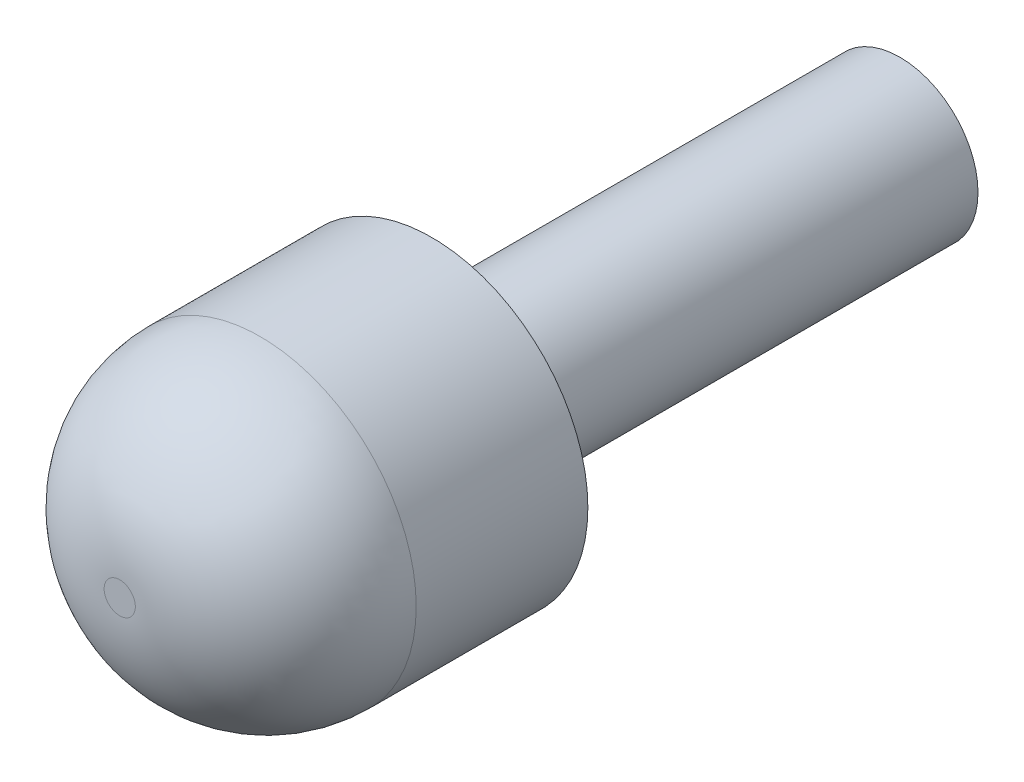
ISO-10303-21;
HEADER;
FILE_DESCRIPTION(('STEP AP214'),'2;1');
FILE_NAME('part.step','',(''),(''),'','','');
FILE_SCHEMA(('AUTOMOTIVE_DESIGN { 1 0 10303 214 1 1 1 1 }'));
ENDSEC;
DATA;
#1=APPLICATION_CONTEXT('core data for automotive mechanical design processes');
#2=APPLICATION_PROTOCOL_DEFINITION('international standard','automotive_design',2000,#1);
#3=PRODUCT_CONTEXT('',#1,'mechanical');
#4=PRODUCT('Part','Part','',(#3));
#5=PRODUCT_RELATED_PRODUCT_CATEGORY('part','',(#4));
#6=PRODUCT_DEFINITION_FORMATION('','',#4);
#7=PRODUCT_DEFINITION_CONTEXT('part definition',#1,'design');
#8=PRODUCT_DEFINITION('design','',#6,#7);
#9=PRODUCT_DEFINITION_SHAPE('','',#8);
#10=(LENGTH_UNIT() NAMED_UNIT(*) SI_UNIT(.MILLI.,.METRE.));
#11=(NAMED_UNIT(*) PLANE_ANGLE_UNIT() SI_UNIT($,.RADIAN.));
#12=(NAMED_UNIT(*) SI_UNIT($,.STERADIAN.) SOLID_ANGLE_UNIT());
#13=UNCERTAINTY_MEASURE_WITH_UNIT(LENGTH_MEASURE(1.E-05),#10,'distance_accuracy_value','');
#14=(GEOMETRIC_REPRESENTATION_CONTEXT(3) GLOBAL_UNCERTAINTY_ASSIGNED_CONTEXT((#13)) GLOBAL_UNIT_ASSIGNED_CONTEXT((#10,
#11,#12)) REPRESENTATION_CONTEXT('',''));
#15=CARTESIAN_POINT('',(0.,0.,0.));
#16=DIRECTION('',(0.,0.,1.));
#17=DIRECTION('',(1.,0.,0.));
#18=AXIS2_PLACEMENT_3D('',#15,#16,#17);
#19=CARTESIAN_POINT('',(0.,0.,-4.));
#20=DIRECTION('',(0.,0.,1.));
#21=DIRECTION('',(1.,0.,0.));
#22=AXIS2_PLACEMENT_3D('',#19,#20,#21);
#23=PLANE('',#22);
#24=CARTESIAN_POINT('',(0.,0.,-4.));
#25=DIRECTION('',(0.,0.,1.));
#26=DIRECTION('',(1.,0.,0.));
#27=AXIS2_PLACEMENT_3D('',#24,#25,#26);
#28=CIRCLE('',#27,2.);
#29=CARTESIAN_POINT('',(2.,0.,-4.));
#30=VERTEX_POINT('',#29);
#31=EDGE_CURVE('E122',#30,#30,#28,.T.);
#32=ORIENTED_EDGE('',*,*,#31,.F.);
#33=EDGE_LOOP('',(#32));
#34=FACE_BOUND('',#33,.T.);
#35=CARTESIAN_POINT('',(0.,0.,-4.));
#36=DIRECTION('',(0.,0.,1.));
#37=DIRECTION('',(1.,0.,0.));
#38=AXIS2_PLACEMENT_3D('',#35,#36,#37);
#39=CIRCLE('',#38,1.);
#40=CARTESIAN_POINT('',(1.,0.,-4.));
#41=VERTEX_POINT('',#40);
#42=EDGE_CURVE('E11',#41,#41,#39,.F.);
#43=ORIENTED_EDGE('',*,*,#42,.F.);
#44=EDGE_LOOP('',(#43));
#45=FACE_BOUND('',#44,.T.);
#46=ADVANCED_FACE('F41',(#34,#45),#23,.F.);
#47=CARTESIAN_POINT('',(0.,0.,-4.));
#48=DIRECTION('',(0.,0.,1.));
#49=DIRECTION('',(1.,0.,0.));
#50=AXIS2_PLACEMENT_3D('',#47,#48,#49);
#51=CYLINDRICAL_SURFACE('',#50,2.);
#52=CARTESIAN_POINT('',(0.,0.,-1.8));
#53=DIRECTION('',(0.,0.,1.));
#54=DIRECTION('',(1.,0.,0.));
#55=AXIS2_PLACEMENT_3D('',#52,#53,#54);
#56=CIRCLE('',#55,2.);
#57=CARTESIAN_POINT('',(2.,0.,-1.8));
#58=VERTEX_POINT('',#57);
#59=EDGE_CURVE('E47',#58,#58,#56,.F.);
#60=ORIENTED_EDGE('',*,*,#59,.T.);
#61=EDGE_LOOP('',(#60));
#62=FACE_BOUND('',#61,.T.);
#63=ORIENTED_EDGE('',*,*,#31,.T.);
#64=EDGE_LOOP('',(#63));
#65=FACE_BOUND('',#64,.T.);
#66=ADVANCED_FACE('F128',(#62,#65),#51,.T.);
#67=CARTESIAN_POINT('',(0.,0.,0.));
#68=DIRECTION('',(0.,0.,1.));
#69=DIRECTION('',(1.,0.,0.));
#70=AXIS2_PLACEMENT_3D('',#67,#68,#69);
#71=PLANE('',#70);
#72=CARTESIAN_POINT('',(0.,0.,0.));
#73=DIRECTION('',(0.,0.,1.));
#74=DIRECTION('',(1.,0.,0.));
#75=AXIS2_PLACEMENT_3D('',#72,#73,#74);
#76=CIRCLE('',#75,0.2);
#77=CARTESIAN_POINT('',(0.2,0.,0.));
#78=VERTEX_POINT('',#77);
#79=EDGE_CURVE('E125',#78,#78,#76,.T.);
#80=ORIENTED_EDGE('',*,*,#79,.T.);
#81=EDGE_LOOP('',(#80));
#82=FACE_BOUND('',#81,.T.);
#83=ADVANCED_FACE('F136',(#82),#71,.T.);
#84=CARTESIAN_POINT('',(0.,0.,-1.8));
#85=DIRECTION('',(0.,0.,1.));
#86=DIRECTION('',(1.,0.,0.));
#87=AXIS2_PLACEMENT_3D('',#84,#85,#86);
#88=DEGENERATE_TOROIDAL_SURFACE('',#87,0.2,1.8,.T.);
#89=ORIENTED_EDGE('',*,*,#59,.F.);
#90=EDGE_LOOP('',(#89));
#91=FACE_BOUND('',#90,.T.);
#92=ORIENTED_EDGE('',*,*,#79,.F.);
#93=EDGE_LOOP('',(#92));
#94=FACE_BOUND('',#93,.T.);
#95=ADVANCED_FACE('F43',(#91,#94),#88,.T.);
#96=CARTESIAN_POINT('',(0.,0.,-10.));
#97=DIRECTION('',(0.,0.,1.));
#98=DIRECTION('',(1.,0.,0.));
#99=AXIS2_PLACEMENT_3D('',#96,#97,#98);
#100=CYLINDRICAL_SURFACE('',#99,1.);
#101=CARTESIAN_POINT('',(0.,0.,-10.));
#102=DIRECTION('',(0.,0.,-1.));
#103=DIRECTION('',(-1.,0.,0.));
#104=AXIS2_PLACEMENT_3D('',#101,#102,#103);
#105=CIRCLE('',#104,1.);
#106=CARTESIAN_POINT('',(-1.,0.,-10.));
#107=VERTEX_POINT('',#106);
#108=EDGE_CURVE('E117',#107,#107,#105,.T.);
#109=ORIENTED_EDGE('',*,*,#108,.F.);
#110=EDGE_LOOP('',(#109));
#111=FACE_BOUND('',#110,.T.);
#112=ORIENTED_EDGE('',*,*,#42,.T.);
#113=EDGE_LOOP('',(#112));
#114=FACE_BOUND('',#113,.T.);
#115=ADVANCED_FACE('F131',(#111,#114),#100,.T.);
#116=CARTESIAN_POINT('',(0.,0.,-10.));
#117=DIRECTION('',(0.,0.,-1.));
#118=DIRECTION('',(-1.,0.,0.));
#119=AXIS2_PLACEMENT_3D('',#116,#117,#118);
#120=PLANE('',#119);
#121=DIRECTION('',(0.,-1.,0.));
#122=VECTOR('',#121,1.);
#123=CARTESIAN_POINT('',(0.5,-0.5,-10.));
#124=LINE('',#123,#122);
#125=CARTESIAN_POINT('',(0.5,0.5,-10.));
#126=VERTEX_POINT('',#125);
#127=CARTESIAN_POINT('',(0.5,-0.5,-10.));
#128=VERTEX_POINT('',#127);
#129=EDGE_CURVE('E57',#126,#128,#124,.T.);
#130=ORIENTED_EDGE('',*,*,#129,.F.);
#131=DIRECTION('',(1.,0.,0.));
#132=VECTOR('',#131,1.);
#133=CARTESIAN_POINT('',(0.5,0.5,-10.));
#134=LINE('',#133,#132);
#135=CARTESIAN_POINT('',(-0.5,0.5,-10.));
#136=VERTEX_POINT('',#135);
#137=EDGE_CURVE('E110',#136,#126,#134,.T.);
#138=ORIENTED_EDGE('',*,*,#137,.F.);
#139=DIRECTION('',(0.,1.,0.));
#140=VECTOR('',#139,1.);
#141=CARTESIAN_POINT('',(-0.5,-0.5,-10.));
#142=LINE('',#141,#140);
#143=CARTESIAN_POINT('',(-0.5,-0.5,-10.));
#144=VERTEX_POINT('',#143);
#145=EDGE_CURVE('E114',#144,#136,#142,.T.);
#146=ORIENTED_EDGE('',*,*,#145,.F.);
#147=DIRECTION('',(-1.,0.,0.));
#148=VECTOR('',#147,1.);
#149=CARTESIAN_POINT('',(0.5,-0.5,-10.));
#150=LINE('',#149,#148);
#151=EDGE_CURVE('E93',#128,#144,#150,.T.);
#152=ORIENTED_EDGE('',*,*,#151,.F.);
#153=EDGE_LOOP('',(#130,#138,#146,#152));
#154=FACE_BOUND('',#153,.T.);
#155=ORIENTED_EDGE('',*,*,#108,.T.);
#156=EDGE_LOOP('',(#155));
#157=FACE_BOUND('',#156,.T.);
#158=ADVANCED_FACE('F152',(#154,#157),#120,.T.);
#159=CARTESIAN_POINT('',(0.5,-0.5,-9.));
#160=DIRECTION('',(1.,0.,0.));
#161=DIRECTION('',(0.,0.,-1.));
#162=AXIS2_PLACEMENT_3D('',#159,#160,#161);
#163=PLANE('',#162);
#164=ORIENTED_EDGE('',*,*,#129,.T.);
#165=DIRECTION('',(0.,0.,-1.));
#166=VECTOR('',#165,1.);
#167=CARTESIAN_POINT('',(0.5,-0.5,-9.));
#168=LINE('',#167,#166);
#169=CARTESIAN_POINT('',(0.5,-0.5,-9.));
#170=VERTEX_POINT('',#169);
#171=EDGE_CURVE('E80',#170,#128,#168,.T.);
#172=ORIENTED_EDGE('',*,*,#171,.F.);
#173=DIRECTION('',(0.,-1.,0.));
#174=VECTOR('',#173,1.);
#175=CARTESIAN_POINT('',(0.5,-0.5,-9.));
#176=LINE('',#175,#174);
#177=CARTESIAN_POINT('',(0.5,0.5,-9.));
#178=VERTEX_POINT('',#177);
#179=EDGE_CURVE('E104',#178,#170,#176,.T.);
#180=ORIENTED_EDGE('',*,*,#179,.F.);
#181=DIRECTION('',(0.,0.,-1.));
#182=VECTOR('',#181,1.);
#183=CARTESIAN_POINT('',(0.5,0.5,-9.));
#184=LINE('',#183,#182);
#185=EDGE_CURVE('E63',#178,#126,#184,.T.);
#186=ORIENTED_EDGE('',*,*,#185,.T.);
#187=EDGE_LOOP('',(#164,#172,#180,#186));
#188=FACE_BOUND('',#187,.T.);
#189=ADVANCED_FACE('F158',(#188),#163,.F.);
#190=CARTESIAN_POINT('',(0.5,0.5,-9.));
#191=DIRECTION('',(0.,1.,0.));
#192=DIRECTION('',(0.,0.,1.));
#193=AXIS2_PLACEMENT_3D('',#190,#191,#192);
#194=PLANE('',#193);
#195=ORIENTED_EDGE('',*,*,#137,.T.);
#196=ORIENTED_EDGE('',*,*,#185,.F.);
#197=DIRECTION('',(1.,0.,0.));
#198=VECTOR('',#197,1.);
#199=CARTESIAN_POINT('',(0.5,0.5,-9.));
#200=LINE('',#199,#198);
#201=CARTESIAN_POINT('',(-0.5,0.5,-9.));
#202=VERTEX_POINT('',#201);
#203=EDGE_CURVE('E105',#202,#178,#200,.T.);
#204=ORIENTED_EDGE('',*,*,#203,.F.);
#205=DIRECTION('',(0.,0.,-1.));
#206=VECTOR('',#205,1.);
#207=CARTESIAN_POINT('',(-0.5,0.5,-9.));
#208=LINE('',#207,#206);
#209=EDGE_CURVE('E92',#202,#136,#208,.T.);
#210=ORIENTED_EDGE('',*,*,#209,.T.);
#211=EDGE_LOOP('',(#195,#196,#204,#210));
#212=FACE_BOUND('',#211,.T.);
#213=ADVANCED_FACE('F165',(#212),#194,.F.);
#214=CARTESIAN_POINT('',(-0.5,-0.5,-9.));
#215=DIRECTION('',(-1.,0.,0.));
#216=DIRECTION('',(0.,0.,1.));
#217=AXIS2_PLACEMENT_3D('',#214,#215,#216);
#218=PLANE('',#217);
#219=ORIENTED_EDGE('',*,*,#145,.T.);
#220=ORIENTED_EDGE('',*,*,#209,.F.);
#221=DIRECTION('',(0.,1.,0.));
#222=VECTOR('',#221,1.);
#223=CARTESIAN_POINT('',(-0.5,-0.5,-9.));
#224=LINE('',#223,#222);
#225=CARTESIAN_POINT('',(-0.5,-0.5,-9.));
#226=VERTEX_POINT('',#225);
#227=EDGE_CURVE('E98',#226,#202,#224,.T.);
#228=ORIENTED_EDGE('',*,*,#227,.F.);
#229=DIRECTION('',(0.,0.,-1.));
#230=VECTOR('',#229,1.);
#231=CARTESIAN_POINT('',(-0.5,-0.5,-9.));
#232=LINE('',#231,#230);
#233=EDGE_CURVE('E83',#226,#144,#232,.T.);
#234=ORIENTED_EDGE('',*,*,#233,.T.);
#235=EDGE_LOOP('',(#219,#220,#228,#234));
#236=FACE_BOUND('',#235,.T.);
#237=ADVANCED_FACE('F97',(#236),#218,.F.);
#238=CARTESIAN_POINT('',(0.5,-0.5,-9.));
#239=DIRECTION('',(0.,-1.,0.));
#240=DIRECTION('',(0.,0.,-1.));
#241=AXIS2_PLACEMENT_3D('',#238,#239,#240);
#242=PLANE('',#241);
#243=ORIENTED_EDGE('',*,*,#151,.T.);
#244=ORIENTED_EDGE('',*,*,#233,.F.);
#245=DIRECTION('',(-1.,0.,0.));
#246=VECTOR('',#245,1.);
#247=CARTESIAN_POINT('',(0.5,-0.5,-9.));
#248=LINE('',#247,#246);
#249=EDGE_CURVE('E86',#170,#226,#248,.T.);
#250=ORIENTED_EDGE('',*,*,#249,.F.);
#251=ORIENTED_EDGE('',*,*,#171,.T.);
#252=EDGE_LOOP('',(#243,#244,#250,#251));
#253=FACE_BOUND('',#252,.T.);
#254=ADVANCED_FACE('F88',(#253),#242,.F.);
#255=CARTESIAN_POINT('',(0.5,0.5,-9.));
#256=DIRECTION('',(0.,0.,1.));
#257=DIRECTION('',(1.,0.,0.));
#258=AXIS2_PLACEMENT_3D('',#255,#256,#257);
#259=PLANE('',#258);
#260=ORIENTED_EDGE('',*,*,#179,.T.);
#261=ORIENTED_EDGE('',*,*,#249,.T.);
#262=ORIENTED_EDGE('',*,*,#227,.T.);
#263=ORIENTED_EDGE('',*,*,#203,.T.);
#264=EDGE_LOOP('',(#260,#261,#262,#263));
#265=FACE_BOUND('',#264,.T.);
#266=ADVANCED_FACE('F102',(#265),#259,.F.);
#267=CLOSED_SHELL('',(#46,#66,#83,#95,#115,#158,#189,#213,#237,#254,#266));
#268=MANIFOLD_SOLID_BREP('B2',#267);
#269=ADVANCED_BREP_SHAPE_REPRESENTATION('',(#18,#268),#14);
#270=SHAPE_DEFINITION_REPRESENTATION(#9,#269);
ENDSEC;
END-ISO-10303-21;
